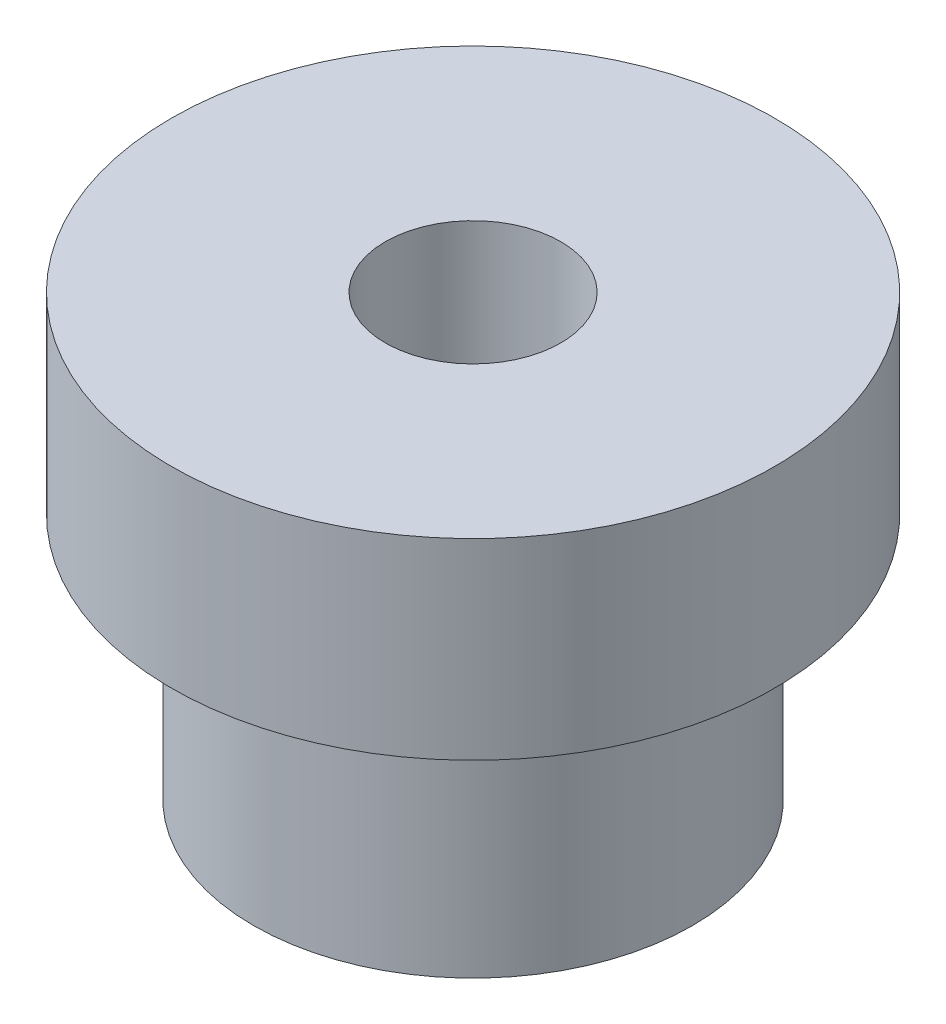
ISO-10303-21;
HEADER;
FILE_DESCRIPTION(('STEP AP214'),'2;1');
FILE_NAME('part.step','',(''),(''),'','','');
FILE_SCHEMA(('AUTOMOTIVE_DESIGN { 1 0 10303 214 1 1 1 1 }'));
ENDSEC;
DATA;
#1=APPLICATION_CONTEXT('core data for automotive mechanical design processes');
#2=APPLICATION_PROTOCOL_DEFINITION('international standard','automotive_design',2000,#1);
#3=PRODUCT_CONTEXT('',#1,'mechanical');
#4=PRODUCT('Part','Part','',(#3));
#5=PRODUCT_RELATED_PRODUCT_CATEGORY('part','',(#4));
#6=PRODUCT_DEFINITION_FORMATION('','',#4);
#7=PRODUCT_DEFINITION_CONTEXT('part definition',#1,'design');
#8=PRODUCT_DEFINITION('design','',#6,#7);
#9=PRODUCT_DEFINITION_SHAPE('','',#8);
#10=(LENGTH_UNIT() NAMED_UNIT(*) SI_UNIT(.MILLI.,.METRE.));
#11=(NAMED_UNIT(*) PLANE_ANGLE_UNIT() SI_UNIT($,.RADIAN.));
#12=(NAMED_UNIT(*) SI_UNIT($,.STERADIAN.) SOLID_ANGLE_UNIT());
#13=UNCERTAINTY_MEASURE_WITH_UNIT(LENGTH_MEASURE(1.E-05),#10,'distance_accuracy_value','');
#14=(GEOMETRIC_REPRESENTATION_CONTEXT(3) GLOBAL_UNCERTAINTY_ASSIGNED_CONTEXT((#13)) GLOBAL_UNIT_ASSIGNED_CONTEXT((#10,
#11,#12)) REPRESENTATION_CONTEXT('',''));
#15=CARTESIAN_POINT('',(0.,0.,0.));
#16=DIRECTION('',(0.,0.,1.));
#17=DIRECTION('',(1.,0.,0.));
#18=AXIS2_PLACEMENT_3D('',#15,#16,#17);
#19=CARTESIAN_POINT('',(1.6,-4.5,0.));
#20=DIRECTION('',(0.,1.,0.));
#21=DIRECTION('',(-1.,0.,0.));
#22=AXIS2_PLACEMENT_3D('',#19,#20,#21);
#23=PLANE('',#22);
#24=CARTESIAN_POINT('',(0.,-4.5,0.));
#25=DIRECTION('',(0.,1.,0.));
#26=DIRECTION('',(-1.,0.,0.));
#27=AXIS2_PLACEMENT_3D('',#24,#25,#26);
#28=CIRCLE('',#27,4.);
#29=CARTESIAN_POINT('',(-4.,-4.5,0.));
#30=VERTEX_POINT('',#29);
#31=EDGE_CURVE('E10',#30,#30,#28,.T.);
#32=ORIENTED_EDGE('',*,*,#31,.F.);
#33=EDGE_LOOP('',(#32));
#34=FACE_BOUND('',#33,.T.);
#35=CARTESIAN_POINT('',(0.,-4.5,0.));
#36=DIRECTION('',(0.,1.,0.));
#37=DIRECTION('',(-1.,0.,0.));
#38=AXIS2_PLACEMENT_3D('',#35,#36,#37);
#39=CIRCLE('',#38,1.6);
#40=CARTESIAN_POINT('',(-1.6,-4.5,0.));
#41=VERTEX_POINT('',#40);
#42=EDGE_CURVE('E48',#41,#41,#39,.T.);
#43=ORIENTED_EDGE('',*,*,#42,.T.);
#44=EDGE_LOOP('',(#43));
#45=FACE_BOUND('',#44,.T.);
#46=ADVANCED_FACE('F26',(#34,#45),#23,.F.);
#47=CARTESIAN_POINT('',(0.,2.66159958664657,0.));
#48=DIRECTION('',(0.,1.,0.));
#49=DIRECTION('',(-1.,0.,0.));
#50=AXIS2_PLACEMENT_3D('',#47,#48,#49);
#51=CYLINDRICAL_SURFACE('',#50,4.);
#52=CARTESIAN_POINT('',(0.,0.,0.));
#53=DIRECTION('',(0.,1.,0.));
#54=DIRECTION('',(-1.,0.,0.));
#55=AXIS2_PLACEMENT_3D('',#52,#53,#54);
#56=CIRCLE('',#55,4.);
#57=CARTESIAN_POINT('',(-4.,0.,0.));
#58=VERTEX_POINT('',#57);
#59=EDGE_CURVE('E32',#58,#58,#56,.T.);
#60=ORIENTED_EDGE('',*,*,#59,.F.);
#61=EDGE_LOOP('',(#60));
#62=FACE_BOUND('',#61,.T.);
#63=ORIENTED_EDGE('',*,*,#31,.T.);
#64=EDGE_LOOP('',(#63));
#65=FACE_BOUND('',#64,.T.);
#66=ADVANCED_FACE('F73',(#62,#65),#51,.T.);
#67=CARTESIAN_POINT('',(4.00000000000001,0.,0.));
#68=DIRECTION('',(0.,1.,0.));
#69=DIRECTION('',(-1.,0.,0.));
#70=AXIS2_PLACEMENT_3D('',#67,#68,#69);
#71=PLANE('',#70);
#72=CARTESIAN_POINT('',(0.,0.,0.));
#73=DIRECTION('',(0.,1.,0.));
#74=DIRECTION('',(-1.,0.,0.));
#75=AXIS2_PLACEMENT_3D('',#72,#73,#74);
#76=CIRCLE('',#75,5.5);
#77=CARTESIAN_POINT('',(-5.5,0.,0.));
#78=VERTEX_POINT('',#77);
#79=EDGE_CURVE('E36',#78,#78,#76,.T.);
#80=ORIENTED_EDGE('',*,*,#79,.F.);
#81=EDGE_LOOP('',(#80));
#82=FACE_BOUND('',#81,.T.);
#83=ORIENTED_EDGE('',*,*,#59,.T.);
#84=EDGE_LOOP('',(#83));
#85=FACE_BOUND('',#84,.T.);
#86=ADVANCED_FACE('F68',(#82,#85),#71,.F.);
#87=CARTESIAN_POINT('',(0.,2.66159958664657,0.));
#88=DIRECTION('',(0.,1.,0.));
#89=DIRECTION('',(-1.,0.,0.));
#90=AXIS2_PLACEMENT_3D('',#87,#88,#89);
#91=CYLINDRICAL_SURFACE('',#90,5.5);
#92=CARTESIAN_POINT('',(0.,3.5,0.));
#93=DIRECTION('',(0.,1.,0.));
#94=DIRECTION('',(-1.,0.,0.));
#95=AXIS2_PLACEMENT_3D('',#92,#93,#94);
#96=CIRCLE('',#95,5.5);
#97=CARTESIAN_POINT('',(-5.5,3.5,0.));
#98=VERTEX_POINT('',#97);
#99=EDGE_CURVE('E40',#98,#98,#96,.T.);
#100=ORIENTED_EDGE('',*,*,#99,.F.);
#101=EDGE_LOOP('',(#100));
#102=FACE_BOUND('',#101,.T.);
#103=ORIENTED_EDGE('',*,*,#79,.T.);
#104=EDGE_LOOP('',(#103));
#105=FACE_BOUND('',#104,.T.);
#106=ADVANCED_FACE('F62',(#102,#105),#91,.T.);
#107=CARTESIAN_POINT('',(5.5,3.5,0.));
#108=DIRECTION('',(0.,-1.,0.));
#109=DIRECTION('',(1.,0.,0.));
#110=AXIS2_PLACEMENT_3D('',#107,#108,#109);
#111=PLANE('',#110);
#112=CARTESIAN_POINT('',(0.,3.5,0.));
#113=DIRECTION('',(0.,1.,0.));
#114=DIRECTION('',(-1.,0.,0.));
#115=AXIS2_PLACEMENT_3D('',#112,#113,#114);
#116=CIRCLE('',#115,1.6);
#117=CARTESIAN_POINT('',(-1.6,3.5,0.));
#118=VERTEX_POINT('',#117);
#119=EDGE_CURVE('E45',#118,#118,#116,.T.);
#120=ORIENTED_EDGE('',*,*,#119,.F.);
#121=EDGE_LOOP('',(#120));
#122=FACE_BOUND('',#121,.T.);
#123=ORIENTED_EDGE('',*,*,#99,.T.);
#124=EDGE_LOOP('',(#123));
#125=FACE_BOUND('',#124,.T.);
#126=ADVANCED_FACE('F56',(#122,#125),#111,.F.);
#127=CARTESIAN_POINT('',(0.,2.66159958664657,0.));
#128=DIRECTION('',(0.,1.,0.));
#129=DIRECTION('',(-1.,0.,0.));
#130=AXIS2_PLACEMENT_3D('',#127,#128,#129);
#131=CYLINDRICAL_SURFACE('',#130,1.6);
#132=ORIENTED_EDGE('',*,*,#42,.F.);
#133=EDGE_LOOP('',(#132));
#134=FACE_BOUND('',#133,.T.);
#135=ORIENTED_EDGE('',*,*,#119,.T.);
#136=EDGE_LOOP('',(#135));
#137=FACE_BOUND('',#136,.T.);
#138=ADVANCED_FACE('F53',(#134,#137),#131,.F.);
#139=CLOSED_SHELL('',(#46,#66,#86,#106,#126,#138));
#140=MANIFOLD_SOLID_BREP('B2',#139);
#141=ADVANCED_BREP_SHAPE_REPRESENTATION('',(#18,#140),#14);
#142=SHAPE_DEFINITION_REPRESENTATION(#9,#141);
ENDSEC;
END-ISO-10303-21;
